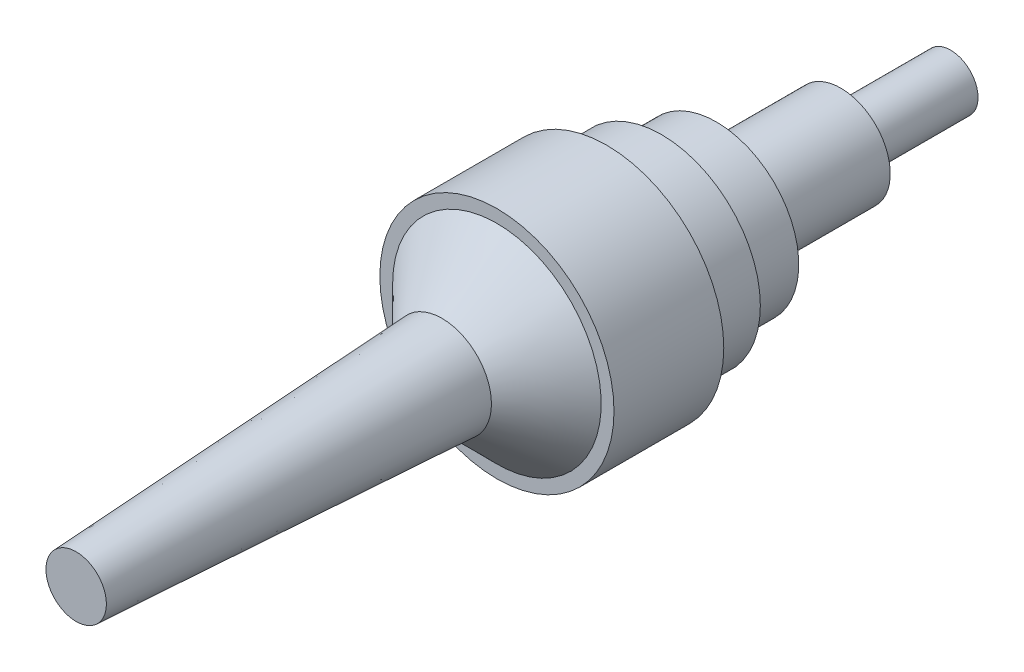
from build123d import *

# Parameters (mm, degrees)
SKETCH1_R           = 1.35
BOSS_EXTRUDE1_DEPTH = 10
BOSS_EXTRUDE1_TAPER = 3
SKETCH2_R           = 1.35
BOSS_EXTRUDE2_DEPTH = 1.5
BOSS_EXTRUDE2_DRAFT = -45
SKETCH3_R           = 3.2
BOSS_EXTRUDE3_DEPTH = 3
SKETCH4_R           = 2.7
BOSS_EXTRUDE4_DEPTH = 1.5
SKETCH5_R           = 2.25
BOSS_EXTRUDE5_DEPTH = 1.5
SKETCH6_R           = 1.35
BOSS_EXTRUDE6_DEPTH = 3.4
SKETCH7_R           = 0.75
BOSS_EXTRUDE7_DEPTH = 3


with BuildPart() as part:
    # Sketch1 → Boss-Extrude1 (new body)
    with BuildSketch(Plane.XY):
        Circle(SKETCH1_R)
    extrude(amount=BOSS_EXTRUDE1_DEPTH, taper=BOSS_EXTRUDE1_TAPER)


with BuildPart() as boss_extrude2_tool:
    # Sketch2 → Boss-Extrude2 (with draft: the straight prism first)
    with BuildSketch(Plane(origin=(0, 0, 0), x_dir=(-1, 0, 0), z_dir=(0, 0, -1))):
        Circle(SKETCH2_R)
    extrude(amount=BOSS_EXTRUDE2_DEPTH)
    # Boss-Extrude2: the draft: its side faces are tilted about the plane it starts from
    boss_extrude2_sides = [boss_extrude2_tool.faces().sort_by_distance(p)[0] for p in [
        (1.35, 0, -0.75),
    ]]
    draft(boss_extrude2_sides, Plane(origin=(0, 0, 0), x_dir=(-1, 0, 0), z_dir=(0, 0, -1)), BOSS_EXTRUDE2_DRAFT)


with BuildPart() as part_1:
    add(part.part)

    # Boss-Extrude2: add boss_extrude2_tool
    add(boss_extrude2_tool.part)

    # Sketch3 → Boss-Extrude3 (add)
    with BuildSketch(Plane(origin=(0, 0, -1.5), x_dir=(-1, 0, 0), z_dir=(0, 0, -1))):
        Circle(SKETCH3_R)
    extrude(amount=BOSS_EXTRUDE3_DEPTH)

    # Sketch4 → Boss-Extrude4 (add)
    with BuildSketch(Plane(origin=(0, 0, -4.5), x_dir=(-1, 0, 0), z_dir=(0, 0, -1))):
        Circle(SKETCH4_R)
    extrude(amount=BOSS_EXTRUDE4_DEPTH)

    # Sketch5 → Boss-Extrude5 (add)
    with BuildSketch(Plane(origin=(0, 0, -6), x_dir=(-1, 0, 0), z_dir=(0, 0, -1))):
        Circle(SKETCH5_R)
    extrude(amount=BOSS_EXTRUDE5_DEPTH)

    # Sketch6 → Boss-Extrude6 (add)
    with BuildSketch(Plane(origin=(0, 0, -7.5), x_dir=(-1, 0, 0), z_dir=(0, 0, -1))):
        Circle(SKETCH6_R)
    extrude(amount=BOSS_EXTRUDE6_DEPTH)

    # Sketch7 → Boss-Extrude7 (add)
    with BuildSketch(Plane(origin=(0, 0, -10.9), x_dir=(-1, 0, 0), z_dir=(0, 0, -1))):
        Circle(SKETCH7_R)
    extrude(amount=BOSS_EXTRUDE7_DEPTH)


solid = part_1.part
